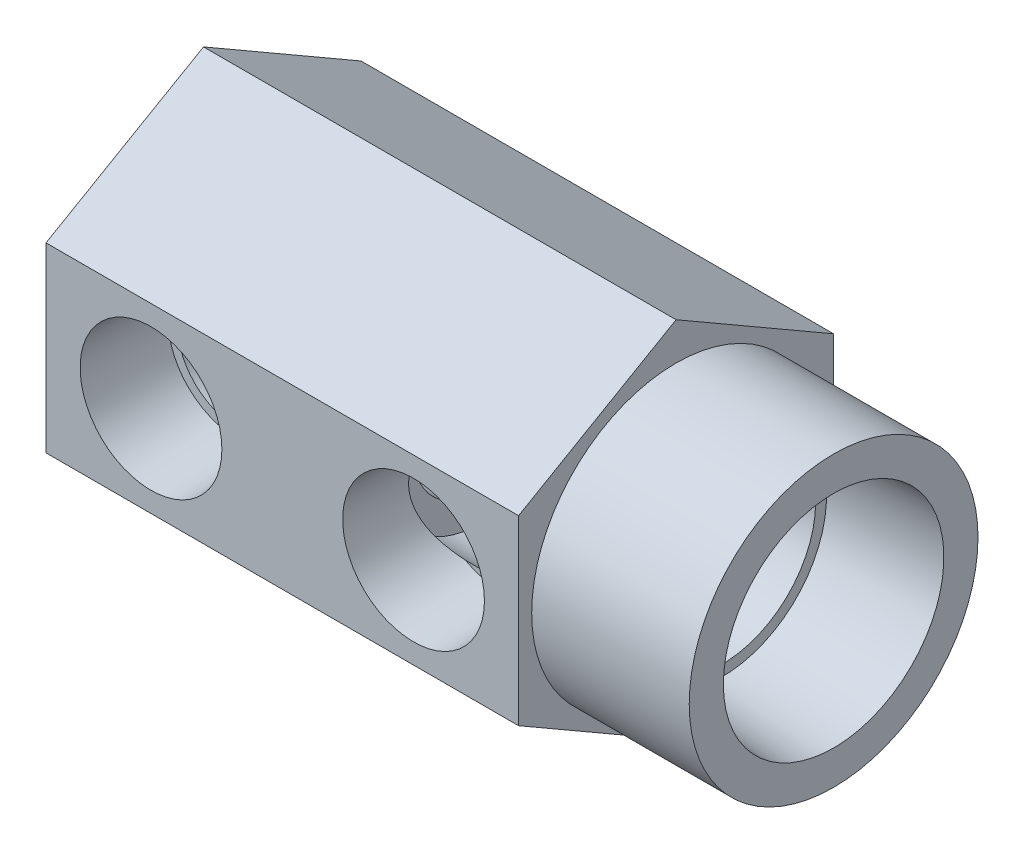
ISO-10303-21;
HEADER;
FILE_DESCRIPTION(('STEP AP214'),'2;1');
FILE_NAME('part.step','',(''),(''),'','','');
FILE_SCHEMA(('AUTOMOTIVE_DESIGN { 1 0 10303 214 1 1 1 1 }'));
ENDSEC;
DATA;
#1=APPLICATION_CONTEXT('core data for automotive mechanical design processes');
#2=APPLICATION_PROTOCOL_DEFINITION('international standard','automotive_design',2000,#1);
#3=PRODUCT_CONTEXT('',#1,'mechanical');
#4=PRODUCT('Part','Part','',(#3));
#5=PRODUCT_RELATED_PRODUCT_CATEGORY('part','',(#4));
#6=PRODUCT_DEFINITION_FORMATION('','',#4);
#7=PRODUCT_DEFINITION_CONTEXT('part definition',#1,'design');
#8=PRODUCT_DEFINITION('design','',#6,#7);
#9=PRODUCT_DEFINITION_SHAPE('','',#8);
#10=(LENGTH_UNIT() NAMED_UNIT(*) SI_UNIT(.MILLI.,.METRE.));
#11=(NAMED_UNIT(*) PLANE_ANGLE_UNIT() SI_UNIT($,.RADIAN.));
#12=(NAMED_UNIT(*) SI_UNIT($,.STERADIAN.) SOLID_ANGLE_UNIT());
#13=UNCERTAINTY_MEASURE_WITH_UNIT(LENGTH_MEASURE(1.E-05),#10,'distance_accuracy_value','');
#14=(GEOMETRIC_REPRESENTATION_CONTEXT(3) GLOBAL_UNCERTAINTY_ASSIGNED_CONTEXT((#13)) GLOBAL_UNIT_ASSIGNED_CONTEXT((#10,
#11,#12)) REPRESENTATION_CONTEXT('',''));
#15=CARTESIAN_POINT('',(0.,0.,0.));
#16=DIRECTION('',(0.,0.,1.));
#17=DIRECTION('',(1.,0.,0.));
#18=AXIS2_PLACEMENT_3D('',#15,#16,#17);
#19=CARTESIAN_POINT('',(76.2,0.,0.));
#20=DIRECTION('',(-1.,0.,0.));
#21=DIRECTION('',(0.,0.,1.));
#22=AXIS2_PLACEMENT_3D('',#19,#20,#21);
#23=PLANE('',#22);
#24=CARTESIAN_POINT('',(76.2,0.,0.));
#25=DIRECTION('',(-1.,0.,0.));
#26=DIRECTION('',(0.,0.,1.));
#27=AXIS2_PLACEMENT_3D('',#24,#25,#26);
#28=CIRCLE('',#27,17.4625);
#29=CARTESIAN_POINT('',(76.2,0.,17.4625));
#30=VERTEX_POINT('',#29);
#31=EDGE_CURVE('E209',#30,#30,#28,.T.);
#32=ORIENTED_EDGE('',*,*,#31,.F.);
#33=EDGE_LOOP('',(#32));
#34=FACE_BOUND('',#33,.T.);
#35=CARTESIAN_POINT('',(76.2,0.,0.));
#36=DIRECTION('',(-1.,0.,0.));
#37=DIRECTION('',(0.,0.,1.));
#38=AXIS2_PLACEMENT_3D('',#35,#36,#37);
#39=CIRCLE('',#38,13.335);
#40=CARTESIAN_POINT('',(76.2,0.,13.335));
#41=VERTEX_POINT('',#40);
#42=EDGE_CURVE('E203',#41,#41,#39,.T.);
#43=ORIENTED_EDGE('',*,*,#42,.T.);
#44=EDGE_LOOP('',(#43));
#45=FACE_BOUND('',#44,.T.);
#46=ADVANCED_FACE('F34',(#34,#45),#23,.F.);
#47=CARTESIAN_POINT('',(57.15,10.9985226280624,19.05));
#48=DIRECTION('',(0.,0.,-1.));
#49=DIRECTION('',(-1.,0.,0.));
#50=AXIS2_PLACEMENT_3D('',#47,#48,#49);
#51=PLANE('',#50);
#52=CARTESIAN_POINT('',(12.7,0.,19.05));
#53=DIRECTION('',(0.,0.,1.));
#54=DIRECTION('',(1.,0.,0.));
#55=AXIS2_PLACEMENT_3D('',#52,#53,#54);
#56=CIRCLE('',#55,8.5725);
#57=CARTESIAN_POINT('',(21.2725,0.,19.05));
#58=VERTEX_POINT('',#57);
#59=EDGE_CURVE('E182',#58,#58,#56,.T.);
#60=ORIENTED_EDGE('',*,*,#59,.F.);
#61=EDGE_LOOP('',(#60));
#62=FACE_BOUND('',#61,.T.);
#63=CARTESIAN_POINT('',(44.45,0.,19.05));
#64=DIRECTION('',(0.,0.,1.));
#65=DIRECTION('',(1.,0.,0.));
#66=AXIS2_PLACEMENT_3D('',#63,#64,#65);
#67=CIRCLE('',#66,8.5725);
#68=CARTESIAN_POINT('',(53.0225,0.,19.05));
#69=VERTEX_POINT('',#68);
#70=EDGE_CURVE('E191',#69,#69,#67,.T.);
#71=ORIENTED_EDGE('',*,*,#70,.F.);
#72=EDGE_LOOP('',(#71));
#73=FACE_BOUND('',#72,.T.);
#74=DIRECTION('',(0.,-1.,0.));
#75=VECTOR('',#74,1.);
#76=CARTESIAN_POINT('',(0.,10.9985226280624,19.05));
#77=LINE('',#76,#75);
#78=CARTESIAN_POINT('',(0.,10.9985226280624,19.05));
#79=VERTEX_POINT('',#78);
#80=CARTESIAN_POINT('',(0.,-10.9985226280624,19.05));
#81=VERTEX_POINT('',#80);
#82=EDGE_CURVE('E212',#79,#81,#77,.T.);
#83=ORIENTED_EDGE('',*,*,#82,.T.);
#84=DIRECTION('',(-1.,0.,0.));
#85=VECTOR('',#84,1.);
#86=CARTESIAN_POINT('',(57.15,-10.9985226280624,19.05));
#87=LINE('',#86,#85);
#88=CARTESIAN_POINT('',(57.15,-10.9985226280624,19.05));
#89=VERTEX_POINT('',#88);
#90=EDGE_CURVE('E217',#89,#81,#87,.T.);
#91=ORIENTED_EDGE('',*,*,#90,.F.);
#92=DIRECTION('',(0.,-1.,0.));
#93=VECTOR('',#92,1.);
#94=CARTESIAN_POINT('',(57.15,10.9985226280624,19.05));
#95=LINE('',#94,#93);
#96=CARTESIAN_POINT('',(57.15,10.9985226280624,19.05));
#97=VERTEX_POINT('',#96);
#98=EDGE_CURVE('E218',#97,#89,#95,.T.);
#99=ORIENTED_EDGE('',*,*,#98,.F.);
#100=DIRECTION('',(-1.,0.,0.));
#101=VECTOR('',#100,1.);
#102=CARTESIAN_POINT('',(57.15,10.9985226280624,19.05));
#103=LINE('',#102,#101);
#104=EDGE_CURVE('E232',#97,#79,#103,.T.);
#105=ORIENTED_EDGE('',*,*,#104,.T.);
#106=EDGE_LOOP('',(#83,#91,#99,#105));
#107=FACE_BOUND('',#106,.T.);
#108=ADVANCED_FACE('F36',(#62,#73,#107),#51,.F.);
#109=CARTESIAN_POINT('',(57.15,-10.9985226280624,19.05));
#110=DIRECTION('',(0.,0.866025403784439,-0.5));
#111=DIRECTION('',(0.,0.5,0.866025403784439));
#112=AXIS2_PLACEMENT_3D('',#109,#110,#111);
#113=PLANE('',#112);
#114=DIRECTION('',(0.,-0.5,-0.866025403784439));
#115=VECTOR('',#114,1.);
#116=CARTESIAN_POINT('',(0.,-10.9985226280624,19.05));
#117=LINE('',#116,#115);
#118=CARTESIAN_POINT('',(0.,-21.9970452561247,0.));
#119=VERTEX_POINT('',#118);
#120=EDGE_CURVE('E235',#81,#119,#117,.T.);
#121=ORIENTED_EDGE('',*,*,#120,.T.);
#122=DIRECTION('',(-1.,0.,0.));
#123=VECTOR('',#122,1.);
#124=CARTESIAN_POINT('',(57.15,-21.9970452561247,0.));
#125=LINE('',#124,#123);
#126=CARTESIAN_POINT('',(57.15,-21.9970452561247,0.));
#127=VERTEX_POINT('',#126);
#128=EDGE_CURVE('E255',#127,#119,#125,.T.);
#129=ORIENTED_EDGE('',*,*,#128,.F.);
#130=DIRECTION('',(0.,-0.5,-0.866025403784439));
#131=VECTOR('',#130,1.);
#132=CARTESIAN_POINT('',(57.15,-10.9985226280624,19.05));
#133=LINE('',#132,#131);
#134=EDGE_CURVE('E221',#89,#127,#133,.T.);
#135=ORIENTED_EDGE('',*,*,#134,.F.);
#136=ORIENTED_EDGE('',*,*,#90,.T.);
#137=EDGE_LOOP('',(#121,#129,#135,#136));
#138=FACE_BOUND('',#137,.T.);
#139=ADVANCED_FACE('F316',(#138),#113,.F.);
#140=CARTESIAN_POINT('',(57.15,-21.9970452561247,0.));
#141=DIRECTION('',(0.,0.866025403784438,0.5));
#142=DIRECTION('',(0.,-0.5,0.866025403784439));
#143=AXIS2_PLACEMENT_3D('',#140,#141,#142);
#144=PLANE('',#143);
#145=DIRECTION('',(0.,0.5,-0.866025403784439));
#146=VECTOR('',#145,1.);
#147=CARTESIAN_POINT('',(0.,-21.9970452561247,0.));
#148=LINE('',#147,#146);
#149=CARTESIAN_POINT('',(0.,-10.9985226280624,-19.05));
#150=VERTEX_POINT('',#149);
#151=EDGE_CURVE('E237',#119,#150,#148,.T.);
#152=ORIENTED_EDGE('',*,*,#151,.T.);
#153=DIRECTION('',(-1.,0.,0.));
#154=VECTOR('',#153,1.);
#155=CARTESIAN_POINT('',(57.15,-10.9985226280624,-19.05));
#156=LINE('',#155,#154);
#157=CARTESIAN_POINT('',(57.15,-10.9985226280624,-19.05));
#158=VERTEX_POINT('',#157);
#159=EDGE_CURVE('E252',#158,#150,#156,.T.);
#160=ORIENTED_EDGE('',*,*,#159,.F.);
#161=DIRECTION('',(0.,0.5,-0.866025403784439));
#162=VECTOR('',#161,1.);
#163=CARTESIAN_POINT('',(57.15,-21.9970452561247,0.));
#164=LINE('',#163,#162);
#165=EDGE_CURVE('E224',#127,#158,#164,.T.);
#166=ORIENTED_EDGE('',*,*,#165,.F.);
#167=ORIENTED_EDGE('',*,*,#128,.T.);
#168=EDGE_LOOP('',(#152,#160,#166,#167));
#169=FACE_BOUND('',#168,.T.);
#170=ADVANCED_FACE('F342',(#169),#144,.F.);
#171=CARTESIAN_POINT('',(57.15,-10.9985226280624,-19.05));
#172=DIRECTION('',(0.,0.,1.));
#173=DIRECTION('',(0.,-1.,0.));
#174=AXIS2_PLACEMENT_3D('',#171,#172,#173);
#175=PLANE('',#174);
#176=CARTESIAN_POINT('',(12.7,0.,-19.05));
#177=DIRECTION('',(0.,0.,-1.));
#178=DIRECTION('',(0.,1.,0.));
#179=AXIS2_PLACEMENT_3D('',#176,#177,#178);
#180=CIRCLE('',#179,8.5725);
#181=CARTESIAN_POINT('',(12.7,8.57250000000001,-19.05));
#182=VERTEX_POINT('',#181);
#183=EDGE_CURVE('E123',#182,#182,#180,.T.);
#184=ORIENTED_EDGE('',*,*,#183,.F.);
#185=EDGE_LOOP('',(#184));
#186=FACE_BOUND('',#185,.T.);
#187=DIRECTION('',(0.,1.,0.));
#188=VECTOR('',#187,1.);
#189=CARTESIAN_POINT('',(0.,-10.9985226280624,-19.05));
#190=LINE('',#189,#188);
#191=CARTESIAN_POINT('',(0.,10.9985226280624,-19.05));
#192=VERTEX_POINT('',#191);
#193=EDGE_CURVE('E239',#150,#192,#190,.T.);
#194=ORIENTED_EDGE('',*,*,#193,.T.);
#195=DIRECTION('',(-1.,0.,0.));
#196=VECTOR('',#195,1.);
#197=CARTESIAN_POINT('',(57.15,10.9985226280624,-19.05));
#198=LINE('',#197,#196);
#199=CARTESIAN_POINT('',(57.15,10.9985226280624,-19.05));
#200=VERTEX_POINT('',#199);
#201=EDGE_CURVE('E249',#200,#192,#198,.T.);
#202=ORIENTED_EDGE('',*,*,#201,.F.);
#203=DIRECTION('',(0.,1.,0.));
#204=VECTOR('',#203,1.);
#205=CARTESIAN_POINT('',(57.15,-10.9985226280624,-19.05));
#206=LINE('',#205,#204);
#207=EDGE_CURVE('E226',#158,#200,#206,.T.);
#208=ORIENTED_EDGE('',*,*,#207,.F.);
#209=ORIENTED_EDGE('',*,*,#159,.T.);
#210=EDGE_LOOP('',(#194,#202,#208,#209));
#211=FACE_BOUND('',#210,.T.);
#212=ADVANCED_FACE('F338',(#186,#211),#175,.F.);
#213=CARTESIAN_POINT('',(57.15,10.9985226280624,-19.05));
#214=DIRECTION('',(0.,-0.866025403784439,0.5));
#215=DIRECTION('',(0.,-0.5,-0.866025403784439));
#216=AXIS2_PLACEMENT_3D('',#213,#214,#215);
#217=PLANE('',#216);
#218=DIRECTION('',(0.,0.5,0.866025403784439));
#219=VECTOR('',#218,1.);
#220=CARTESIAN_POINT('',(0.,10.9985226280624,-19.05));
#221=LINE('',#220,#219);
#222=CARTESIAN_POINT('',(0.,21.9970452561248,0.));
#223=VERTEX_POINT('',#222);
#224=EDGE_CURVE('E241',#192,#223,#221,.T.);
#225=ORIENTED_EDGE('',*,*,#224,.T.);
#226=DIRECTION('',(-1.,0.,0.));
#227=VECTOR('',#226,1.);
#228=CARTESIAN_POINT('',(57.15,21.9970452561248,0.));
#229=LINE('',#228,#227);
#230=CARTESIAN_POINT('',(57.15,21.9970452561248,0.));
#231=VERTEX_POINT('',#230);
#232=EDGE_CURVE('E246',#231,#223,#229,.T.);
#233=ORIENTED_EDGE('',*,*,#232,.F.);
#234=DIRECTION('',(0.,0.5,0.866025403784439));
#235=VECTOR('',#234,1.);
#236=CARTESIAN_POINT('',(57.15,10.9985226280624,-19.05));
#237=LINE('',#236,#235);
#238=EDGE_CURVE('E228',#200,#231,#237,.T.);
#239=ORIENTED_EDGE('',*,*,#238,.F.);
#240=ORIENTED_EDGE('',*,*,#201,.T.);
#241=EDGE_LOOP('',(#225,#233,#239,#240));
#242=FACE_BOUND('',#241,.T.);
#243=ADVANCED_FACE('F334',(#242),#217,.F.);
#244=CARTESIAN_POINT('',(57.15,21.9970452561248,0.));
#245=DIRECTION('',(0.,-0.866025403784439,-0.5));
#246=DIRECTION('',(0.,0.5,-0.866025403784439));
#247=AXIS2_PLACEMENT_3D('',#244,#245,#246);
#248=PLANE('',#247);
#249=DIRECTION('',(0.,-0.5,0.866025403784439));
#250=VECTOR('',#249,1.);
#251=CARTESIAN_POINT('',(0.,21.9970452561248,0.));
#252=LINE('',#251,#250);
#253=EDGE_CURVE('E222',#223,#79,#252,.T.);
#254=ORIENTED_EDGE('',*,*,#253,.T.);
#255=ORIENTED_EDGE('',*,*,#104,.F.);
#256=DIRECTION('',(0.,-0.5,0.866025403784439));
#257=VECTOR('',#256,1.);
#258=CARTESIAN_POINT('',(57.15,21.9970452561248,0.));
#259=LINE('',#258,#257);
#260=EDGE_CURVE('E230',#231,#97,#259,.T.);
#261=ORIENTED_EDGE('',*,*,#260,.F.);
#262=ORIENTED_EDGE('',*,*,#232,.T.);
#263=EDGE_LOOP('',(#254,#255,#261,#262));
#264=FACE_BOUND('',#263,.T.);
#265=ADVANCED_FACE('F327',(#264),#248,.F.);
#266=CARTESIAN_POINT('',(57.15,-10.9985226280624,19.05));
#267=DIRECTION('',(1.,0.,0.));
#268=DIRECTION('',(0.,0.,-1.));
#269=AXIS2_PLACEMENT_3D('',#266,#267,#268);
#270=PLANE('',#269);
#271=CARTESIAN_POINT('',(57.15,0.,0.));
#272=DIRECTION('',(1.,0.,0.));
#273=DIRECTION('',(0.,0.,-1.));
#274=AXIS2_PLACEMENT_3D('',#271,#272,#273);
#275=CIRCLE('',#274,17.4625);
#276=CARTESIAN_POINT('',(57.15,0.,17.4625));
#277=VERTEX_POINT('',#276);
#278=EDGE_CURVE('E213',#277,#277,#275,.T.);
#279=ORIENTED_EDGE('',*,*,#278,.F.);
#280=EDGE_LOOP('',(#279));
#281=FACE_BOUND('',#280,.T.);
#282=ORIENTED_EDGE('',*,*,#98,.T.);
#283=ORIENTED_EDGE('',*,*,#134,.T.);
#284=ORIENTED_EDGE('',*,*,#165,.T.);
#285=ORIENTED_EDGE('',*,*,#207,.T.);
#286=ORIENTED_EDGE('',*,*,#238,.T.);
#287=ORIENTED_EDGE('',*,*,#260,.T.);
#288=EDGE_LOOP('',(#282,#283,#284,#285,#286,#287));
#289=FACE_BOUND('',#288,.T.);
#290=ADVANCED_FACE('F324',(#281,#289),#270,.T.);
#291=CARTESIAN_POINT('',(0.,-10.9985226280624,19.05));
#292=DIRECTION('',(1.,0.,0.));
#293=DIRECTION('',(0.,0.,-1.));
#294=AXIS2_PLACEMENT_3D('',#291,#292,#293);
#295=PLANE('',#294);
#296=ORIENTED_EDGE('',*,*,#82,.F.);
#297=ORIENTED_EDGE('',*,*,#253,.F.);
#298=ORIENTED_EDGE('',*,*,#224,.F.);
#299=ORIENTED_EDGE('',*,*,#193,.F.);
#300=ORIENTED_EDGE('',*,*,#151,.F.);
#301=ORIENTED_EDGE('',*,*,#120,.F.);
#302=EDGE_LOOP('',(#296,#297,#298,#299,#300,#301));
#303=FACE_BOUND('',#302,.T.);
#304=ADVANCED_FACE('F322',(#303),#295,.F.);
#305=CARTESIAN_POINT('',(76.2,0.,0.));
#306=DIRECTION('',(-1.,0.,0.));
#307=DIRECTION('',(0.,0.,1.));
#308=AXIS2_PLACEMENT_3D('',#305,#306,#307);
#309=CYLINDRICAL_SURFACE('',#308,17.4625);
#310=CARTESIAN_POINT('',(57.15,0.,17.4625));
#311=CARTESIAN_POINT('',(57.3484375,0.,17.4625));
#312=CARTESIAN_POINT('',(57.546875,0.,17.4625));
#313=CARTESIAN_POINT('',(57.94375,0.,17.4625));
#314=CARTESIAN_POINT('',(58.1421875,0.,17.4625));
#315=CARTESIAN_POINT('',(58.5390625,0.,17.4625));
#316=CARTESIAN_POINT('',(58.7375,0.,17.4625));
#317=CARTESIAN_POINT('',(59.134375,0.,17.4625));
#318=CARTESIAN_POINT('',(59.3328125,0.,17.4625));
#319=CARTESIAN_POINT('',(59.7296875,0.,17.4625));
#320=CARTESIAN_POINT('',(59.928125,0.,17.4625));
#321=CARTESIAN_POINT('',(60.325,0.,17.4625));
#322=CARTESIAN_POINT('',(60.5234375,0.,17.4625));
#323=CARTESIAN_POINT('',(60.9203125,0.,17.4625));
#324=CARTESIAN_POINT('',(61.11875,0.,17.4625));
#325=CARTESIAN_POINT('',(61.515625,0.,17.4625));
#326=CARTESIAN_POINT('',(61.7140625,0.,17.4625));
#327=CARTESIAN_POINT('',(62.1109375,0.,17.4625));
#328=CARTESIAN_POINT('',(62.309375,0.,17.4625));
#329=CARTESIAN_POINT('',(62.70625,0.,17.4625));
#330=CARTESIAN_POINT('',(62.9046875,0.,17.4625));
#331=CARTESIAN_POINT('',(63.3015625,0.,17.4625));
#332=CARTESIAN_POINT('',(63.5,0.,17.4625));
#333=CARTESIAN_POINT('',(63.896875,0.,17.4625));
#334=CARTESIAN_POINT('',(64.0953125,0.,17.4625));
#335=CARTESIAN_POINT('',(64.4921875,0.,17.4625));
#336=CARTESIAN_POINT('',(64.690625,0.,17.4625));
#337=CARTESIAN_POINT('',(65.0875,0.,17.4625));
#338=CARTESIAN_POINT('',(65.2859375,0.,17.4625));
#339=CARTESIAN_POINT('',(65.6828125,0.,17.4625));
#340=CARTESIAN_POINT('',(65.88125,0.,17.4625));
#341=CARTESIAN_POINT('',(66.278125,0.,17.4625));
#342=CARTESIAN_POINT('',(66.4765625,0.,17.4625));
#343=CARTESIAN_POINT('',(66.8734375,0.,17.4625));
#344=CARTESIAN_POINT('',(67.071875,0.,17.4625));
#345=CARTESIAN_POINT('',(67.46875,0.,17.4625));
#346=CARTESIAN_POINT('',(67.6671875,0.,17.4625));
#347=CARTESIAN_POINT('',(68.0640625,0.,17.4625));
#348=CARTESIAN_POINT('',(68.2625,0.,17.4625));
#349=CARTESIAN_POINT('',(68.659375,0.,17.4625));
#350=CARTESIAN_POINT('',(68.8578125,0.,17.4625));
#351=CARTESIAN_POINT('',(69.2546875,0.,17.4625));
#352=CARTESIAN_POINT('',(69.453125,0.,17.4625));
#353=CARTESIAN_POINT('',(69.85,0.,17.4625));
#354=CARTESIAN_POINT('',(70.0484375,0.,17.4625));
#355=CARTESIAN_POINT('',(70.4453125,0.,17.4625));
#356=CARTESIAN_POINT('',(70.64375,0.,17.4625));
#357=CARTESIAN_POINT('',(71.040625,0.,17.4625));
#358=CARTESIAN_POINT('',(71.2390625,0.,17.4625));
#359=CARTESIAN_POINT('',(71.6359375,0.,17.4625));
#360=CARTESIAN_POINT('',(71.834375,0.,17.4625));
#361=CARTESIAN_POINT('',(72.23125,0.,17.4625));
#362=CARTESIAN_POINT('',(72.4296875,0.,17.4625));
#363=CARTESIAN_POINT('',(72.8265625,0.,17.4625));
#364=CARTESIAN_POINT('',(73.025,0.,17.4625));
#365=CARTESIAN_POINT('',(73.421875,0.,17.4625));
#366=CARTESIAN_POINT('',(73.6203125,0.,17.4625));
#367=CARTESIAN_POINT('',(74.0171875,0.,17.4625));
#368=CARTESIAN_POINT('',(74.215625,0.,17.4625));
#369=CARTESIAN_POINT('',(74.6125,0.,17.4625));
#370=CARTESIAN_POINT('',(74.8109375,0.,17.4625));
#371=CARTESIAN_POINT('',(75.2078125,0.,17.4625));
#372=CARTESIAN_POINT('',(75.40625,0.,17.4625));
#373=CARTESIAN_POINT('',(75.803125,0.,17.4625));
#374=CARTESIAN_POINT('',(76.0015625,0.,17.4625));
#375=CARTESIAN_POINT('',(76.2,0.,17.4625));
#376=B_SPLINE_CURVE_WITH_KNOTS('',3,(#310,#311,#312,#313,#314,#315,#316,#317,#318,#319,#320,
#321,#322,#323,#324,#325,#326,#327,#328,#329,#330,#331,#332,#333,#334,#335,#336,#337,#338,#339,
#340,#341,#342,#343,#344,#345,#346,#347,#348,#349,#350,#351,#352,#353,#354,#355,#356,#357,#358,
#359,#360,#361,#362,#363,#364,#365,#366,#367,#368,#369,#370,#371,#372,#373,#374,#375),
.UNSPECIFIED.,.F.,.F.,(4,2,2,2,2,2,2,2,2,2,2,2,2,2,2,2,2,2,2,2,2,2,2,2,2,2,2,2,2,2,2,2,4),(0.,
0.5953125,1.190625,1.7859375,2.38125,2.9765625,3.571875,4.1671875,4.7625,5.3578125,5.953125,
6.5484375,7.14375,7.7390625,8.334375,8.92968750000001,9.52500000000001,10.1203125,10.715625,
11.3109375,11.90625,12.5015625,13.096875,13.6921875,14.2875,14.8828125,15.478125,16.0734375,
16.66875,17.2640625,17.859375,18.4546875,19.05),.UNSPECIFIED.);
#377=EDGE_CURVE('BSEAM301',#277,#30,#376,.T.);
#378=ORIENTED_EDGE('',*,*,#278,.T.);
#379=ORIENTED_EDGE('',*,*,#31,.T.);
#380=ORIENTED_EDGE('',*,*,#377,.T.);
#381=ORIENTED_EDGE('',*,*,#377,.F.);
#382=EDGE_LOOP('',(#378,#380,#379,#381));
#383=FACE_BOUND('',#382,.T.);
#384=ADVANCED_FACE('F301',(#383),#309,.T.);
#385=CARTESIAN_POINT('',(62.7126,11.3157,0.));
#386=DIRECTION('',(1.,0.,0.));
#387=DIRECTION('',(0.,0.,-1.));
#388=AXIS2_PLACEMENT_3D('',#385,#386,#387);
#389=PLANE('',#388);
#390=CARTESIAN_POINT('',(62.7126,0.,0.));
#391=DIRECTION('',(-1.,0.,0.));
#392=DIRECTION('',(0.,0.,1.));
#393=AXIS2_PLACEMENT_3D('',#390,#391,#392);
#394=CIRCLE('',#393,11.3157);
#395=CARTESIAN_POINT('',(62.7126,0.,11.3157));
#396=VERTEX_POINT('',#395);
#397=EDGE_CURVE('E197',#396,#396,#394,.T.);
#398=ORIENTED_EDGE('',*,*,#397,.T.);
#399=EDGE_LOOP('',(#398));
#400=FACE_BOUND('',#399,.T.);
#401=CARTESIAN_POINT('',(62.7126,0.,0.));
#402=DIRECTION('',(-1.,0.,0.));
#403=DIRECTION('',(0.,0.,1.));
#404=AXIS2_PLACEMENT_3D('',#401,#402,#403);
#405=CIRCLE('',#404,12.6281553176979);
#406=CARTESIAN_POINT('',(62.7126,0.,12.6281553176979));
#407=VERTEX_POINT('',#406);
#408=EDGE_CURVE('E206',#407,#407,#405,.T.);
#409=ORIENTED_EDGE('',*,*,#408,.F.);
#410=EDGE_LOOP('',(#409));
#411=FACE_BOUND('',#410,.T.);
#412=ADVANCED_FACE('F297',(#400,#411),#389,.T.);
#413=CARTESIAN_POINT('',(76.2,0.,0.));
#414=DIRECTION('',(1.,0.,0.));
#415=DIRECTION('',(0.,0.,-1.));
#416=AXIS2_PLACEMENT_3D('',#413,#414,#415);
#417=CONICAL_SURFACE('',#416,13.335,0.0523598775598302);
#418=ORIENTED_EDGE('',*,*,#408,.T.);
#419=EDGE_LOOP('',(#418));
#420=FACE_BOUND('',#419,.T.);
#421=ORIENTED_EDGE('',*,*,#42,.F.);
#422=EDGE_LOOP('',(#421));
#423=FACE_BOUND('',#422,.T.);
#424=ADVANCED_FACE('F300',(#420,#423),#417,.F.);
#425=CARTESIAN_POINT('',(33.3375,0.,0.));
#426=DIRECTION('',(1.,0.,0.));
#427=DIRECTION('',(0.,0.,-1.));
#428=AXIS2_PLACEMENT_3D('',#425,#426,#427);
#429=PLANE('',#428);
#430=CARTESIAN_POINT('',(33.3375,0.,0.));
#431=DIRECTION('',(1.,0.,0.));
#432=DIRECTION('',(0.,0.,-1.));
#433=AXIS2_PLACEMENT_3D('',#430,#431,#432);
#434=CIRCLE('',#433,7.93749999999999);
#435=CARTESIAN_POINT('',(33.3375,0.,-7.93749999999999));
#436=VERTEX_POINT('',#435);
#437=EDGE_CURVE('E38',#436,#436,#434,.T.);
#438=ORIENTED_EDGE('',*,*,#437,.F.);
#439=EDGE_LOOP('',(#438));
#440=FACE_BOUND('',#439,.T.);
#441=CARTESIAN_POINT('',(33.3375,0.,0.));
#442=DIRECTION('',(-1.,0.,0.));
#443=DIRECTION('',(0.,0.,1.));
#444=AXIS2_PLACEMENT_3D('',#441,#442,#443);
#445=CIRCLE('',#444,11.3157);
#446=CARTESIAN_POINT('',(33.3375,0.,11.3157));
#447=VERTEX_POINT('',#446);
#448=EDGE_CURVE('E200',#447,#447,#445,.T.);
#449=ORIENTED_EDGE('',*,*,#448,.F.);
#450=EDGE_LOOP('',(#449));
#451=FACE_BOUND('',#450,.T.);
#452=ADVANCED_FACE('F292',(#440,#451),#429,.T.);
#453=CARTESIAN_POINT('',(0.,0.,0.));
#454=DIRECTION('',(-1.,0.,0.));
#455=DIRECTION('',(0.,0.,1.));
#456=AXIS2_PLACEMENT_3D('',#453,#454,#455);
#457=CYLINDRICAL_SURFACE('',#456,11.3157);
#458=CARTESIAN_POINT('',(48.4832482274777,7.21202423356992,8.71962000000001));
#459=CARTESIAN_POINT('',(48.5925124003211,7.15260118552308,8.76877049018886));
#460=CARTESIAN_POINT('',(48.7001386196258,7.09091491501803,8.81876664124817));
#461=CARTESIAN_POINT('',(48.9120877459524,6.96309485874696,8.92003476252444));
#462=CARTESIAN_POINT('',(49.0164109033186,6.89696141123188,8.97130663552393));
#463=CARTESIAN_POINT('',(49.324389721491,6.6920075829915,9.12641430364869));
#464=CARTESIAN_POINT('',(49.5230754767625,6.54662240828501,9.23155163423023));
#465=CARTESIAN_POINT('',(49.9084902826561,6.23742271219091,9.44325653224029));
#466=CARTESIAN_POINT('',(50.0950828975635,6.0734413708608,9.54982801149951));
#467=CARTESIAN_POINT('',(50.4534552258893,5.72859397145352,9.76058958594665));
#468=CARTESIAN_POINT('',(50.6252350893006,5.54772808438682,9.86477970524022));
#469=CARTESIAN_POINT('',(50.95334425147,5.16902744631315,10.0683940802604));
#470=CARTESIAN_POINT('',(51.1096332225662,4.9711507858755,10.1678055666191));
#471=CARTESIAN_POINT('',(51.4048898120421,4.5593498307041,10.3590018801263));
#472=CARTESIAN_POINT('',(51.5438562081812,4.34542440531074,10.4507861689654));
#473=CARTESIAN_POINT('',(51.8021903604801,3.90338216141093,10.6237828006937));
#474=CARTESIAN_POINT('',(51.9216413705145,3.67533167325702,10.7050397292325));
#475=CARTESIAN_POINT('',(52.1397533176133,3.20558061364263,10.854953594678));
#476=CARTESIAN_POINT('',(52.2384234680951,2.96388615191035,10.9236161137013));
#477=CARTESIAN_POINT('',(52.3882932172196,2.53902338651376,11.0286830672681));
#478=CARTESIAN_POINT('',(52.445021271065,2.35868013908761,11.0687148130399));
#479=CARTESIAN_POINT('',(52.5461470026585,1.99295086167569,11.1403728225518));
#480=CARTESIAN_POINT('',(52.5905474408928,1.80756597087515,11.1720009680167));
#481=CARTESIAN_POINT('',(52.6664301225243,1.43287943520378,11.226208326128));
#482=CARTESIAN_POINT('',(52.6979134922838,1.24357813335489,11.2487883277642));
#483=CARTESIAN_POINT('',(52.7475140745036,0.862328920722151,11.284418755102));
#484=CARTESIAN_POINT('',(52.7656308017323,0.670380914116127,11.2974688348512));
#485=CARTESIAN_POINT('',(52.7882410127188,0.28487061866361,11.313762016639));
#486=CARTESIAN_POINT('',(52.7927065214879,0.0913058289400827,11.3169849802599));
#487=CARTESIAN_POINT('',(52.7878647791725,-0.295559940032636,11.3134932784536));
#488=CARTESIAN_POINT('',(52.7785575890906,-0.488860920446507,11.3067786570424));
#489=CARTESIAN_POINT('',(52.7463150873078,-0.873744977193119,11.2835637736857));
#490=CARTESIAN_POINT('',(52.7233783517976,-1.06532787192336,11.2670624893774));
#491=CARTESIAN_POINT('',(52.6642226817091,-1.44536483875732,11.2246401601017));
#492=CARTESIAN_POINT('',(52.6280037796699,-1.63381891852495,11.1987191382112));
#493=CARTESIAN_POINT('',(52.5440099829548,-2.00105020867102,11.1388729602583));
#494=CARTESIAN_POINT('',(52.4965927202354,-2.17995022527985,11.1051961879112));
#495=CARTESIAN_POINT('',(52.3902683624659,-2.53269300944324,11.0300982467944));
#496=CARTESIAN_POINT('',(52.3313572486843,-2.70653398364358,10.988674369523));
#497=CARTESIAN_POINT('',(52.2027106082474,-3.04823801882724,10.8988304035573));
#498=CARTESIAN_POINT('',(52.1329779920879,-3.21610267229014,10.8504121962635));
#499=CARTESIAN_POINT('',(51.9833334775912,-3.54528615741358,10.74736285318));
#500=CARTESIAN_POINT('',(51.9034179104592,-3.70660260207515,10.6927294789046));
#501=CARTESIAN_POINT('',(51.6304772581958,-4.21511504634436,10.5079429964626));
#502=CARTESIAN_POINT('',(51.4185805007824,-4.54853539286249,10.3670960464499));
#503=CARTESIAN_POINT('',(50.9538811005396,-5.1770594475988,10.0679980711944));
#504=CARTESIAN_POINT('',(50.7010294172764,-5.47211644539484,9.90972625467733));
#505=CARTESIAN_POINT('',(50.2869266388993,-5.89231855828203,9.66199714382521));
#506=CARTESIAN_POINT('',(50.1385941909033,-6.03205879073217,9.57522276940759));
#507=CARTESIAN_POINT('',(49.8322222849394,-6.30008554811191,9.40103824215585));
#508=CARTESIAN_POINT('',(49.6741827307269,-6.42837195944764,9.31362808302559));
#509=CARTESIAN_POINT('',(49.3492433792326,-6.67287312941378,9.14003397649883));
#510=CARTESIAN_POINT('',(49.1823706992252,-6.78912192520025,9.05384720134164));
#511=CARTESIAN_POINT('',(48.8395561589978,-7.00964171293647,8.88422371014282));
#512=CARTESIAN_POINT('',(48.6636139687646,-7.11391226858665,8.80078709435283));
#513=CARTESIAN_POINT('',(48.4832482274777,-7.21202423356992,8.71962));
#514=B_SPLINE_CURVE_WITH_KNOTS('',3,(#458,#459,#460,#461,#462,#463,#464,#465,#466,#467,#468,
#469,#470,#471,#472,#473,#474,#475,#476,#477,#478,#479,#480,#481,#482,#483,#484,#485,#486,#487,
#488,#489,#490,#491,#492,#493,#494,#495,#496,#497,#498,#499,#500,#501,#502,#503,#504,#505,#506,
#507,#508,#509,#510,#511,#512,#513),.UNSPECIFIED.,.F.,.F.,(4,2,2,2,2,2,2,2,2,2,2,2,2,2,2,2,2,2,
2,2,2,2,2,2,2,2,2,4),(0.,0.401138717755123,0.802246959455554,1.60438729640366,2.41439762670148,
3.22439975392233,4.03645804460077,4.84857359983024,5.65712865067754,6.46532446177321,
7.04448228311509,7.62351031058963,8.20248783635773,8.78148637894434,9.36167065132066,
9.94185235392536,10.5220946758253,11.1023355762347,11.66608787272,12.2300376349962,
12.793835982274,13.3578380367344,14.6111296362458,15.8659332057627,16.5299841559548,
17.1940416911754,17.8561671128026,18.5183166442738),.UNSPECIFIED.);
#515=CARTESIAN_POINT('',(48.4836928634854,7.2117824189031,8.71982000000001));
#516=VERTEX_POINT('',#515);
#517=CARTESIAN_POINT('',(48.4836928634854,-7.2117824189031,8.71982000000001));
#518=VERTEX_POINT('',#517);
#519=EDGE_CURVE('E117',#516,#518,#514,.T.);
#520=ORIENTED_EDGE('',*,*,#519,.F.);
#521=DIRECTION('',(-1.,0.,0.));
#522=VECTOR('',#521,1.);
#523=CARTESIAN_POINT('',(0.,7.2117824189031,8.71982000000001));
#524=LINE('',#523,#522);
#525=CARTESIAN_POINT('',(40.4163071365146,7.2117824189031,8.71982000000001));
#526=VERTEX_POINT('',#525);
#527=EDGE_CURVE('E265',#526,#516,#524,.F.);
#528=ORIENTED_EDGE('',*,*,#527,.F.);
#529=CARTESIAN_POINT('',(40.4167517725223,-7.21202423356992,8.71962000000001));
#530=CARTESIAN_POINT('',(40.3074875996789,-7.15260118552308,8.76877049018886));
#531=CARTESIAN_POINT('',(40.1998613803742,-7.09091491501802,8.81876664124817));
#532=CARTESIAN_POINT('',(39.9879122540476,-6.96309485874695,8.92003476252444));
#533=CARTESIAN_POINT('',(39.8835890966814,-6.89696141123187,8.97130663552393));
#534=CARTESIAN_POINT('',(39.575610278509,-6.6920075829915,9.12641430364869));
#535=CARTESIAN_POINT('',(39.3769245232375,-6.54662240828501,9.23155163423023));
#536=CARTESIAN_POINT('',(38.9915097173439,-6.2374227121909,9.44325653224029));
#537=CARTESIAN_POINT('',(38.8049171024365,-6.0734413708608,9.54982801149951));
#538=CARTESIAN_POINT('',(38.4465447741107,-5.72859397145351,9.76058958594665));
#539=CARTESIAN_POINT('',(38.2747649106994,-5.54772808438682,9.86477970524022));
#540=CARTESIAN_POINT('',(37.94665574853,-5.16902744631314,10.0683940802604));
#541=CARTESIAN_POINT('',(37.7903667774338,-4.97115078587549,10.1678055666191));
#542=CARTESIAN_POINT('',(37.4951101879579,-4.55934983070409,10.3590018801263));
#543=CARTESIAN_POINT('',(37.3561437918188,-4.34542440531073,10.4507861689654));
#544=CARTESIAN_POINT('',(37.0978096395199,-3.90338216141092,10.6237828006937));
#545=CARTESIAN_POINT('',(36.9783586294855,-3.67533167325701,10.7050397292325));
#546=CARTESIAN_POINT('',(36.7602466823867,-3.20558061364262,10.854953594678));
#547=CARTESIAN_POINT('',(36.6615765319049,-2.96388615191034,10.9236161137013));
#548=CARTESIAN_POINT('',(36.5117067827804,-2.53902338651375,11.0286830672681));
#549=CARTESIAN_POINT('',(36.4549787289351,-2.3586801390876,11.0687148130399));
#550=CARTESIAN_POINT('',(36.3538529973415,-1.99295086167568,11.1403728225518));
#551=CARTESIAN_POINT('',(36.3094525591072,-1.80756597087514,11.1720009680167));
#552=CARTESIAN_POINT('',(36.2335698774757,-1.43287943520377,11.226208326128));
#553=CARTESIAN_POINT('',(36.2020865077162,-1.24357813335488,11.2487883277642));
#554=CARTESIAN_POINT('',(36.1524859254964,-0.862328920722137,11.284418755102));
#555=CARTESIAN_POINT('',(36.1343691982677,-0.670380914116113,11.2974688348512));
#556=CARTESIAN_POINT('',(36.1117589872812,-0.284870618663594,11.313762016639));
#557=CARTESIAN_POINT('',(36.1072934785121,-0.0913058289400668,11.3169849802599));
#558=CARTESIAN_POINT('',(36.1121352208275,0.295559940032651,11.3134932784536));
#559=CARTESIAN_POINT('',(36.1214424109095,0.488860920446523,11.3067786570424));
#560=CARTESIAN_POINT('',(36.1536849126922,0.873744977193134,11.2835637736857));
#561=CARTESIAN_POINT('',(36.1766216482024,1.06532787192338,11.2670624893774));
#562=CARTESIAN_POINT('',(36.2357773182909,1.44536483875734,11.2246401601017));
#563=CARTESIAN_POINT('',(36.2719962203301,1.63381891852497,11.1987191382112));
#564=CARTESIAN_POINT('',(36.3559900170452,2.00105020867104,11.1388729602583));
#565=CARTESIAN_POINT('',(36.4034072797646,2.17995022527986,11.1051961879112));
#566=CARTESIAN_POINT('',(36.5097316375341,2.53269300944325,11.0300982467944));
#567=CARTESIAN_POINT('',(36.5686427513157,2.70653398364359,10.988674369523));
#568=CARTESIAN_POINT('',(36.6972893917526,3.04823801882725,10.8988304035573));
#569=CARTESIAN_POINT('',(36.7670220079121,3.21610267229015,10.8504121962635));
#570=CARTESIAN_POINT('',(36.9166665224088,3.54528615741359,10.74736285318));
#571=CARTESIAN_POINT('',(36.9965820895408,3.70660260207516,10.6927294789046));
#572=CARTESIAN_POINT('',(37.2695227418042,4.21511504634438,10.5079429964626));
#573=CARTESIAN_POINT('',(37.4814194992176,4.5485353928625,10.3670960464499));
#574=CARTESIAN_POINT('',(37.9461188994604,5.17705944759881,10.0679980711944));
#575=CARTESIAN_POINT('',(38.1989705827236,5.47211644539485,9.90972625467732));
#576=CARTESIAN_POINT('',(38.6130733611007,5.89231855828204,9.6619971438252));
#577=CARTESIAN_POINT('',(38.7614058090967,6.03205879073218,9.57522276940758));
#578=CARTESIAN_POINT('',(39.0677777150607,6.30008554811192,9.40103824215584));
#579=CARTESIAN_POINT('',(39.2258172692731,6.42837195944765,9.31362808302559));
#580=CARTESIAN_POINT('',(39.5507566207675,6.67287312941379,9.14003397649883));
#581=CARTESIAN_POINT('',(39.7176293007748,6.78912192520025,9.05384720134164));
#582=CARTESIAN_POINT('',(40.0604438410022,7.00964171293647,8.88422371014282));
#583=CARTESIAN_POINT('',(40.2363860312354,7.11391226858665,8.80078709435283));
#584=CARTESIAN_POINT('',(40.4167517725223,7.21202423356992,8.71962));
#585=B_SPLINE_CURVE_WITH_KNOTS('',3,(#529,#530,#531,#532,#533,#534,#535,#536,#537,#538,#539,
#540,#541,#542,#543,#544,#545,#546,#547,#548,#549,#550,#551,#552,#553,#554,#555,#556,#557,#558,
#559,#560,#561,#562,#563,#564,#565,#566,#567,#568,#569,#570,#571,#572,#573,#574,#575,#576,#577,
#578,#579,#580,#581,#582,#583,#584),.UNSPECIFIED.,.F.,.F.,(4,2,2,2,2,2,2,2,2,2,2,2,2,2,2,2,2,2,
2,2,2,2,2,2,2,2,2,4),(0.,0.401138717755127,0.802246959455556,1.60438729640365,2.41439762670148,
3.22439975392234,4.03645804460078,4.84857359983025,5.65712865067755,6.46532446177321,
7.04448228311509,7.62351031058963,8.20248783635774,8.78148637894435,9.36167065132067,
9.94185235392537,10.5220946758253,11.1023355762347,11.66608787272,12.2300376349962,
12.793835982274,13.3578380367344,14.6111296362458,15.8659332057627,16.5299841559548,
17.1940416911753,17.8561671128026,18.5183166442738),.UNSPECIFIED.);
#586=CARTESIAN_POINT('',(40.4163071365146,-7.2117824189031,8.71982000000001));
#587=VERTEX_POINT('',#586);
#588=EDGE_CURVE('E216',#587,#526,#585,.T.);
#589=ORIENTED_EDGE('',*,*,#588,.F.);
#590=DIRECTION('',(-1.,0.,0.));
#591=VECTOR('',#590,1.);
#592=CARTESIAN_POINT('',(0.,-7.2117824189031,8.71982000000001));
#593=LINE('',#592,#591);
#594=EDGE_CURVE('E279',#518,#587,#593,.T.);
#595=ORIENTED_EDGE('',*,*,#594,.F.);
#596=EDGE_LOOP('',(#520,#528,#589,#595));
#597=FACE_BOUND('',#596,.T.);
#598=ORIENTED_EDGE('',*,*,#448,.T.);
#599=EDGE_LOOP('',(#598));
#600=FACE_BOUND('',#599,.T.);
#601=ORIENTED_EDGE('',*,*,#397,.F.);
#602=EDGE_LOOP('',(#601));
#603=FACE_BOUND('',#602,.T.);
#604=ADVANCED_FACE('F267',(#597,#600,#603),#457,.F.);
#605=CARTESIAN_POINT('',(51.5874,0.,8.71982000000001));
#606=DIRECTION('',(0.,0.,-1.));
#607=DIRECTION('',(-1.,0.,0.));
#608=AXIS2_PLACEMENT_3D('',#605,#606,#607);
#609=PLANE('',#608);
#610=ORIENTED_EDGE('',*,*,#594,.T.);
#611=CARTESIAN_POINT('',(44.45,0.,8.71982000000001));
#612=DIRECTION('',(0.,0.,1.));
#613=DIRECTION('',(1.,0.,0.));
#614=AXIS2_PLACEMENT_3D('',#611,#612,#613);
#615=CIRCLE('',#614,8.26320057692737);
#616=EDGE_CURVE('E58',#587,#518,#615,.T.);
#617=ORIENTED_EDGE('',*,*,#616,.T.);
#618=EDGE_LOOP('',(#610,#617));
#619=FACE_BOUND('',#618,.T.);
#620=ADVANCED_FACE('F291',(#619),#609,.F.);
#621=ORIENTED_EDGE('',*,*,#527,.T.);
#622=EDGE_CURVE('E194',#516,#526,#615,.T.);
#623=ORIENTED_EDGE('',*,*,#622,.T.);
#624=EDGE_LOOP('',(#621,#623));
#625=FACE_BOUND('',#624,.T.);
#626=ADVANCED_FACE('F274',(#625),#609,.F.);
#627=CARTESIAN_POINT('',(44.45,0.,19.05));
#628=DIRECTION('',(0.,0.,1.));
#629=DIRECTION('',(1.,0.,0.));
#630=AXIS2_PLACEMENT_3D('',#627,#628,#629);
#631=CONICAL_SURFACE('',#630,8.5725,0.0299323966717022);
#632=ORIENTED_EDGE('',*,*,#519,.T.);
#633=ORIENTED_EDGE('',*,*,#616,.F.);
#634=ORIENTED_EDGE('',*,*,#588,.T.);
#635=ORIENTED_EDGE('',*,*,#622,.F.);
#636=EDGE_LOOP('',(#632,#633,#634,#635));
#637=FACE_BOUND('',#636,.T.);
#638=ORIENTED_EDGE('',*,*,#70,.T.);
#639=EDGE_LOOP('',(#638));
#640=FACE_BOUND('',#639,.T.);
#641=ADVANCED_FACE('F271',(#637,#640),#631,.F.);
#642=CARTESIAN_POINT('',(12.7,0.,19.05));
#643=DIRECTION('',(0.,0.,1.));
#644=DIRECTION('',(1.,0.,0.));
#645=AXIS2_PLACEMENT_3D('',#642,#643,#644);
#646=CYLINDRICAL_SURFACE('',#645,7.13740000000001);
#647=CARTESIAN_POINT('',(12.7,7.13740000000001,1.72225752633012));
#648=CARTESIAN_POINT('',(12.7595870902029,7.13740780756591,1.72219425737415));
#649=CARTESIAN_POINT('',(12.8191089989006,7.13665371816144,1.72535095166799));
#650=CARTESIAN_POINT('',(12.9373255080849,7.13369560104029,1.73755665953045));
#651=CARTESIAN_POINT('',(12.996022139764,7.1314961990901,1.74658687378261));
#652=CARTESIAN_POINT('',(13.1679033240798,7.12295687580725,1.78120041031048));
#653=CARTESIAN_POINT('',(13.2794774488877,7.11466879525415,1.81435476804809));
#654=CARTESIAN_POINT('',(13.4789752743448,7.09535627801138,1.88832491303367));
#655=CARTESIAN_POINT('',(13.5678044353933,7.08499166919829,1.92703275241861));
#656=CARTESIAN_POINT('',(13.7417729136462,7.06150716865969,2.01138947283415));
#657=CARTESIAN_POINT('',(13.8269092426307,7.04838509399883,2.05704384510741));
#658=CARTESIAN_POINT('',(13.9951261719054,7.01943851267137,2.15376824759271));
#659=CARTESIAN_POINT('',(14.0781618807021,7.00357904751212,2.20490461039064));
#660=CARTESIAN_POINT('',(14.2415025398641,6.969447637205,2.31052718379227));
#661=CARTESIAN_POINT('',(14.3218083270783,6.95117643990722,2.36501235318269));
#662=CARTESIAN_POINT('',(14.5219562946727,6.9020636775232,2.50564353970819));
#663=CARTESIAN_POINT('',(14.6403255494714,6.86967276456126,2.59333965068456));
#664=CARTESIAN_POINT('',(14.8731228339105,6.7996160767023,2.77183896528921));
#665=CARTESIAN_POINT('',(14.9875493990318,6.76194836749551,2.86264329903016));
#666=CARTESIAN_POINT('',(15.2132879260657,6.68133530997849,3.04605562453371));
#667=CARTESIAN_POINT('',(15.3245960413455,6.63838376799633,3.13866562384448));
#668=CARTESIAN_POINT('',(15.5443880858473,6.54721927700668,3.32465173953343));
#669=CARTESIAN_POINT('',(15.6528716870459,6.49900572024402,3.41802794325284));
#670=CARTESIAN_POINT('',(15.973744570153,6.34673745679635,3.69763002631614));
#671=CARTESIAN_POINT('',(16.1823413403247,6.23477367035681,3.88398153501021));
#672=CARTESIAN_POINT('',(16.5895359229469,5.98919216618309,4.25292562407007));
#673=CARTESIAN_POINT('',(16.7881416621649,5.85559198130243,4.43552111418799));
#674=CARTESIAN_POINT('',(17.1351778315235,5.59540755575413,4.75748883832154));
#675=CARTESIAN_POINT('',(17.2855741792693,5.47295915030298,4.89807499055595));
#676=CARTESIAN_POINT('',(17.5786935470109,5.21336629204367,5.17352108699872));
#677=CARTESIAN_POINT('',(17.7214155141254,5.07621983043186,5.30838024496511));
#678=CARTESIAN_POINT('',(18.1360240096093,4.64240256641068,5.70164913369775));
#679=CARTESIAN_POINT('',(18.3950713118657,4.32282715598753,5.94942196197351));
#680=CARTESIAN_POINT('',(18.8044052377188,3.71172889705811,6.34252648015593));
#681=CARTESIAN_POINT('',(18.9655552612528,3.43398196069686,6.49784259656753));
#682=CARTESIAN_POINT('',(19.181432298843,2.99337467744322,6.70632441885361));
#683=CARTESIAN_POINT('',(19.2490767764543,2.84252721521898,6.77172995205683));
#684=CARTESIAN_POINT('',(19.374782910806,2.53329365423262,6.8933770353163));
#685=CARTESIAN_POINT('',(19.4328459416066,2.37490864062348,6.94961989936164));
#686=CARTESIAN_POINT('',(19.5304635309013,2.07561872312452,7.04423746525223));
#687=CARTESIAN_POINT('',(19.5714872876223,1.93563802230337,7.08402632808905));
#688=CARTESIAN_POINT('',(19.6452503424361,1.65151632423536,7.15559876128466));
#689=CARTESIAN_POINT('',(19.6779911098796,1.50737606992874,7.1873837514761));
#690=CARTESIAN_POINT('',(19.7346508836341,1.21581680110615,7.2424055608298));
#691=CARTESIAN_POINT('',(19.7585732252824,1.06839904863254,7.26564561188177));
#692=CARTESIAN_POINT('',(19.7971926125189,0.771222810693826,7.30317007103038));
#693=CARTESIAN_POINT('',(19.8118895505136,0.62146429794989,7.31745437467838));
#694=CARTESIAN_POINT('',(19.8318110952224,0.320293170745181,7.33681776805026));
#695=CARTESIAN_POINT('',(19.8370086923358,0.16887706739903,7.34187060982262));
#696=CARTESIAN_POINT('',(19.8377487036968,-0.134001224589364,7.34258997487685));
#697=CARTESIAN_POINT('',(19.8332911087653,-0.285463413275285,7.33825648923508));
#698=CARTESIAN_POINT('',(19.8148058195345,-0.587261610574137,7.32028880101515));
#699=CARTESIAN_POINT('',(19.8007769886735,-0.737597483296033,7.30665349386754));
#700=CARTESIAN_POINT('',(19.7634132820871,-1.03599463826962,7.27034791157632));
#701=CARTESIAN_POINT('',(19.7400784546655,-1.18405593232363,7.24767768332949));
#702=CARTESIAN_POINT('',(19.6856648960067,-1.47084082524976,7.19483457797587));
#703=CARTESIAN_POINT('',(19.6549461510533,-1.60969741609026,7.16501057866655));
#704=CARTESIAN_POINT('',(19.5858043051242,-1.88365940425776,7.09791538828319));
#705=CARTESIAN_POINT('',(19.5473782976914,-2.0187633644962,7.06064138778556));
#706=CARTESIAN_POINT('',(19.4213104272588,-2.41743388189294,6.93842594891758));
#707=CARTESIAN_POINT('',(19.3228435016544,-2.67453979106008,6.84305682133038));
#708=CARTESIAN_POINT('',(19.1350038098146,-3.09338853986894,6.66146046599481));
#709=CARTESIAN_POINT('',(19.0517777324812,-3.26058554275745,6.58108631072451));
#710=CARTESIAN_POINT('',(18.8749398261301,-3.58421264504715,6.41057781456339));
#711=CARTESIAN_POINT('',(18.7813246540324,-3.74063925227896,6.32044033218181));
#712=CARTESIAN_POINT('',(18.4865598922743,-4.1938316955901,6.03717195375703));
#713=CARTESIAN_POINT('',(18.2717160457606,-4.47402349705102,5.83140329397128));
#714=CARTESIAN_POINT('',(17.88697452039,-4.90852074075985,5.46521601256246));
#715=CARTESIAN_POINT('',(17.7242079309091,-5.07469443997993,5.31090272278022));
#716=CARTESIAN_POINT('',(17.3877782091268,-5.38700906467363,4.99382234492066));
#717=CARTESIAN_POINT('',(17.2141101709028,-5.5331408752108,4.83105145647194));
#718=CARTESIAN_POINT('',(16.8576347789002,-5.8057635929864,4.49974939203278));
#719=CARTESIAN_POINT('',(16.6748363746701,-5.93227325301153,4.33122390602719));
#720=CARTESIAN_POINT('',(16.3007993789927,-6.16647287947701,3.99073145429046));
#721=CARTESIAN_POINT('',(16.1095640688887,-6.27417008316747,3.81876584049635));
#722=CARTESIAN_POINT('',(15.7148919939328,-6.47323355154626,3.47083699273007));
#723=CARTESIAN_POINT('',(15.5112937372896,-6.56425596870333,3.29485923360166));
#724=CARTESIAN_POINT('',(15.1979611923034,-6.68694525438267,3.03360027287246));
#725=CARTESIAN_POINT('',(15.0920943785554,-6.72556315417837,2.94688744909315));
#726=CARTESIAN_POINT('',(14.8772885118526,-6.79814399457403,2.77534497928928));
#727=CARTESIAN_POINT('',(14.7683499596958,-6.83210768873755,2.69051503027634));
#728=CARTESIAN_POINT('',(14.566095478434,-6.88978953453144,2.53867003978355));
#729=CARTESIAN_POINT('',(14.4733846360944,-6.91426031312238,2.47113678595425));
#730=CARTESIAN_POINT('',(14.2847941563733,-6.95990813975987,2.33948155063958));
#731=CARTESIAN_POINT('',(14.1889153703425,-6.98108606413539,2.27535866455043));
#732=CARTESIAN_POINT('',(13.9933977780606,-7.01993706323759,2.15250204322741));
#733=CARTESIAN_POINT('',(13.8937697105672,-7.03761935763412,2.09375435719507));
#734=CARTESIAN_POINT('',(13.6896112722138,-7.06921453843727,1.98446050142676));
#735=CARTESIAN_POINT('',(13.5850884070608,-7.0831329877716,1.93390227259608));
#736=CARTESIAN_POINT('',(13.3743659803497,-7.10623042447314,1.84717808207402));
#737=CARTESIAN_POINT('',(13.2683918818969,-7.11557348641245,1.81052656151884));
#738=CARTESIAN_POINT('',(13.05184381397,-7.12953385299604,1.7547946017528));
#739=CARTESIAN_POINT('',(12.941296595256,-7.13417545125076,1.73562388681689));
#740=CARTESIAN_POINT('',(12.7867449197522,-7.13700904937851,1.72386624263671));
#741=CARTESIAN_POINT('',(12.7433759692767,-7.1374092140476,1.72219236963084));
#742=CARTESIAN_POINT('',(12.7,-7.13740000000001,1.72225752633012));
#743=B_SPLINE_CURVE_WITH_KNOTS('',3,(#647,#648,#649,#650,#651,#652,#653,#654,#655,#656,#657,
#658,#659,#660,#661,#662,#663,#664,#665,#666,#667,#668,#669,#670,#671,#672,#673,#674,#675,#676,
#677,#678,#679,#680,#681,#682,#683,#684,#685,#686,#687,#688,#689,#690,#691,#692,#693,#694,#695,
#696,#697,#698,#699,#700,#701,#702,#703,#704,#705,#706,#707,#708,#709,#710,#711,#712,#713,#714,
#715,#716,#717,#718,#719,#720,#721,#722,#723,#724,#725,#726,#727,#728,#729,#730,#731,#732,#733,
#734,#735,#736,#737,#738,#739,#740,#741,#742),.UNSPECIFIED.,.F.,.F.,(4,2,2,2,2,2,2,2,2,2,2,2,2,
2,2,2,2,2,2,2,2,2,2,2,2,2,2,2,2,2,2,2,2,2,2,2,2,2,2,2,2,2,2,2,2,2,2,4),(0.,0.178562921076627,
0.356557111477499,0.70488594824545,0.996848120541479,1.28904230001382,1.58528923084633,
1.88144451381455,2.33370880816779,2.78613932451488,3.23910532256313,3.69212369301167,
4.59499217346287,5.49713265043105,6.21510009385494,6.93316578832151,8.36598334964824,
9.43185513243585,9.96466378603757,10.4973959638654,10.9505286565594,11.4035809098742,
11.8564616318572,12.3093476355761,12.7635193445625,13.2176914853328,13.6719175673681,
14.1261412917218,14.5615886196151,14.9972004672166,15.8678681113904,16.4771106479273,
17.086549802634,18.3071429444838,19.1436376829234,19.9805116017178,20.8165807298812,
21.6523275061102,22.5037355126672,22.9302175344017,23.3566304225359,23.7083679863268,
24.0600117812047,24.410715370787,24.7608977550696,25.0973841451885,25.432122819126,
25.5622212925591),.UNSPECIFIED.);
#744=CARTESIAN_POINT('',(12.7,7.13740000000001,1.7222575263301));
#745=VERTEX_POINT('',#744);
#746=CARTESIAN_POINT('',(12.7,-7.13740000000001,1.7222575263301));
#747=VERTEX_POINT('',#746);
#748=EDGE_CURVE('E43',#745,#747,#743,.T.);
#749=ORIENTED_EDGE('',*,*,#748,.T.);
#750=CARTESIAN_POINT('',(13.5329643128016,-7.08862816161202,5.0930048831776));
#751=CARTESIAN_POINT('',(13.4626435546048,-7.09690189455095,4.88085205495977));
#752=CARTESIAN_POINT('',(13.3945755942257,-7.10382787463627,4.66788738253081));
#753=CARTESIAN_POINT('',(13.2636523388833,-7.11541181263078,4.23900856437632));
#754=CARTESIAN_POINT('',(13.2008281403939,-7.12005694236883,4.02308460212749));
#755=CARTESIAN_POINT('',(13.0439381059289,-7.1297752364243,3.45083209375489));
#756=CARTESIAN_POINT('',(12.955538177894,-7.13322780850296,3.09288740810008));
#757=CARTESIAN_POINT('',(12.8027630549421,-7.13707475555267,2.37170623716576));
#758=CARTESIAN_POINT('',(12.7383883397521,-7.13746906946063,2.00846964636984));
#759=CARTESIAN_POINT('',(12.664565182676,-7.13735315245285,1.46143312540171));
#760=CARTESIAN_POINT('',(12.6437688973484,-7.13719776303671,1.2791399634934));
#761=CARTESIAN_POINT('',(12.6102366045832,-7.13685564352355,0.913822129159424));
#762=CARTESIAN_POINT('',(12.5974996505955,-7.13666891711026,0.73079754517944));
#763=CARTESIAN_POINT('',(12.5804988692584,-7.13640469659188,0.364391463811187));
#764=CARTESIAN_POINT('',(12.5762331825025,-7.13632717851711,0.181010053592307));
#765=CARTESIAN_POINT('',(12.5763045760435,-7.1363277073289,-0.185737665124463));
#766=CARTESIAN_POINT('',(12.5806412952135,-7.13640574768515,-0.369103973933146));
#767=CARTESIAN_POINT('',(12.602077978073,-7.13674181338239,-0.826956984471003));
#768=CARTESIAN_POINT('',(12.624471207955,-7.13707027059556,-1.10120796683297));
#769=CARTESIAN_POINT('',(12.6867754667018,-7.13745381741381,-1.64765977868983));
#770=CARTESIAN_POINT('',(12.7266869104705,-7.13750890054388,-1.91986055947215));
#771=CARTESIAN_POINT('',(12.8218429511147,-7.13651834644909,-2.46280179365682));
#772=CARTESIAN_POINT('',(12.877156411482,-7.13546770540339,-2.73352998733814));
#773=CARTESIAN_POINT('',(13.0004079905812,-7.1313415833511,-3.27204765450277));
#774=CARTESIAN_POINT('',(13.0683465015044,-7.12826603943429,-3.5398370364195));
#775=CARTESIAN_POINT('',(13.2385083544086,-7.11771925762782,-4.16055427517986));
#776=CARTESIAN_POINT('',(13.3446436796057,-7.10913158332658,-4.51238516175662));
#777=CARTESIAN_POINT('',(13.5701534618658,-7.08506810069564,-5.21158370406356));
#778=CARTESIAN_POINT('',(13.6895314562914,-7.06959044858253,-5.55895013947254));
#779=CARTESIAN_POINT('',(13.9380855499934,-7.03032577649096,-6.2500966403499));
#780=CARTESIAN_POINT('',(14.0672721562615,-7.00652974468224,-6.59387239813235));
#781=CARTESIAN_POINT('',(14.3326853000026,-6.94947865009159,-7.2778531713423));
#782=CARTESIAN_POINT('',(14.4689110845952,-6.91622459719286,-7.61805856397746));
#783=CARTESIAN_POINT('',(14.7462272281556,-6.83930646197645,-8.29460218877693));
#784=CARTESIAN_POINT('',(14.8873087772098,-6.79566046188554,-8.63094608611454));
#785=CARTESIAN_POINT('',(15.173088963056,-6.6969526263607,-9.3004423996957));
#786=CARTESIAN_POINT('',(15.3177878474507,-6.64189000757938,-9.63359459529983));
#787=CARTESIAN_POINT('',(15.6094666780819,-6.51939307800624,-10.2962157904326));
#788=CARTESIAN_POINT('',(15.7564442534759,-6.45197092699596,-10.6256880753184));
#789=CARTESIAN_POINT('',(16.0518010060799,-6.30358894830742,-11.2808994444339));
#790=CARTESIAN_POINT('',(16.2001799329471,-6.22263149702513,-11.606639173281));
#791=CARTESIAN_POINT('',(16.4073132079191,-6.09942085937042,-12.0576145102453));
#792=CARTESIAN_POINT('',(16.4658662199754,-6.06345901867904,-12.1846811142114));
#793=CARTESIAN_POINT('',(16.5829925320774,-5.98912887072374,-12.4380969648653));
#794=CARTESIAN_POINT('',(16.6415658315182,-5.95076062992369,-12.5644462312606));
#795=CARTESIAN_POINT('',(16.8171999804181,-5.83190337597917,-12.9422644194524));
#796=CARTESIAN_POINT('',(16.9342076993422,-5.74764258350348,-13.1925746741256));
#797=CARTESIAN_POINT('',(17.0509153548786,-5.65791607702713,-13.4411031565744));
#798=B_SPLINE_CURVE_WITH_KNOTS('',3,(#750,#751,#752,#753,#754,#755,#756,#757,#758,#759,#760,
#761,#762,#763,#764,#765,#766,#767,#768,#769,#770,#771,#772,#773,#774,#775,#776,#777,#778,#779,
#780,#781,#782,#783,#784,#785,#786,#787,#788,#789,#790,#791,#792,#793,#794,#795,#796,#797),
.UNSPECIFIED.,.F.,.F.,(4,2,2,2,2,2,2,2,2,2,2,2,2,2,2,2,2,2,2,2,2,2,2,4),(0.,0.670964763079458,
1.34566119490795,2.4511703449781,3.55670156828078,4.10697638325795,4.65718655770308,
5.207275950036,5.75734225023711,6.58216915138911,7.40701558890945,8.23561088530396,
9.06423192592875,10.1665726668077,11.2692085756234,12.3730427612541,13.4767591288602,
14.5785688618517,15.6804542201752,16.7812612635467,17.8818752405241,18.3152275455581,
18.7485678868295,19.6150074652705),.UNSPECIFIED.);
#799=CARTESIAN_POINT('',(12.7,-7.13740000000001,-1.7222575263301));
#800=VERTEX_POINT('',#799);
#801=EDGE_CURVE('E11',#747,#800,#798,.T.);
#802=ORIENTED_EDGE('',*,*,#801,.T.);
#803=CARTESIAN_POINT('',(12.7,-7.13740000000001,-1.72225752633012));
#804=CARTESIAN_POINT('',(12.7595870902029,-7.13740780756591,-1.72219425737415));
#805=CARTESIAN_POINT('',(12.8191089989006,-7.13665371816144,-1.72535095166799));
#806=CARTESIAN_POINT('',(12.9373255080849,-7.13369560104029,-1.73755665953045));
#807=CARTESIAN_POINT('',(12.996022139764,-7.1314961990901,-1.74658687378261));
#808=CARTESIAN_POINT('',(13.1679033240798,-7.12295687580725,-1.78120041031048));
#809=CARTESIAN_POINT('',(13.2794774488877,-7.11466879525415,-1.81435476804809));
#810=CARTESIAN_POINT('',(13.4789752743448,-7.09535627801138,-1.88832491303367));
#811=CARTESIAN_POINT('',(13.5678044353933,-7.08499166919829,-1.92703275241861));
#812=CARTESIAN_POINT('',(13.7417729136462,-7.06150716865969,-2.01138947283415));
#813=CARTESIAN_POINT('',(13.8269092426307,-7.04838509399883,-2.05704384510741));
#814=CARTESIAN_POINT('',(13.9951261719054,-7.01943851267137,-2.15376824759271));
#815=CARTESIAN_POINT('',(14.0781618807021,-7.00357904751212,-2.20490461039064));
#816=CARTESIAN_POINT('',(14.2415025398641,-6.969447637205,-2.31052718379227));
#817=CARTESIAN_POINT('',(14.3218083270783,-6.95117643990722,-2.36501235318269));
#818=CARTESIAN_POINT('',(14.5219562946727,-6.9020636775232,-2.50564353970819));
#819=CARTESIAN_POINT('',(14.6403255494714,-6.86967276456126,-2.59333965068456));
#820=CARTESIAN_POINT('',(14.8731228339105,-6.7996160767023,-2.77183896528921));
#821=CARTESIAN_POINT('',(14.9875493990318,-6.76194836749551,-2.86264329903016));
#822=CARTESIAN_POINT('',(15.2132879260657,-6.68133530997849,-3.04605562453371));
#823=CARTESIAN_POINT('',(15.3245960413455,-6.63838376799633,-3.13866562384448));
#824=CARTESIAN_POINT('',(15.5443880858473,-6.54721927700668,-3.32465173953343));
#825=CARTESIAN_POINT('',(15.6528716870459,-6.49900572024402,-3.41802794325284));
#826=CARTESIAN_POINT('',(15.973744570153,-6.34673745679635,-3.69763002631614));
#827=CARTESIAN_POINT('',(16.1823413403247,-6.23477367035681,-3.88398153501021));
#828=CARTESIAN_POINT('',(16.5895359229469,-5.98919216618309,-4.25292562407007));
#829=CARTESIAN_POINT('',(16.7881416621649,-5.85559198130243,-4.43552111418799));
#830=CARTESIAN_POINT('',(17.1351778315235,-5.59540755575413,-4.75748883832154));
#831=CARTESIAN_POINT('',(17.2855741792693,-5.47295915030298,-4.89807499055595));
#832=CARTESIAN_POINT('',(17.5786935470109,-5.21336629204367,-5.17352108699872));
#833=CARTESIAN_POINT('',(17.7214155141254,-5.07621983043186,-5.30838024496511));
#834=CARTESIAN_POINT('',(18.1360240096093,-4.64240256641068,-5.70164913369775));
#835=CARTESIAN_POINT('',(18.3950713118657,-4.32282715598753,-5.94942196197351));
#836=CARTESIAN_POINT('',(18.8044052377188,-3.71172889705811,-6.34252648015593));
#837=CARTESIAN_POINT('',(18.9655552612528,-3.43398196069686,-6.49784259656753));
#838=CARTESIAN_POINT('',(19.181432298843,-2.99337467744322,-6.70632441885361));
#839=CARTESIAN_POINT('',(19.2490767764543,-2.84252721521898,-6.77172995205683));
#840=CARTESIAN_POINT('',(19.374782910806,-2.53329365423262,-6.8933770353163));
#841=CARTESIAN_POINT('',(19.4328459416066,-2.37490864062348,-6.94961989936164));
#842=CARTESIAN_POINT('',(19.5304635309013,-2.07561872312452,-7.04423746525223));
#843=CARTESIAN_POINT('',(19.5714872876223,-1.93563802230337,-7.08402632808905));
#844=CARTESIAN_POINT('',(19.6452503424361,-1.65151632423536,-7.15559876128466));
#845=CARTESIAN_POINT('',(19.6779911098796,-1.50737606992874,-7.1873837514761));
#846=CARTESIAN_POINT('',(19.7346508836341,-1.21581680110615,-7.2424055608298));
#847=CARTESIAN_POINT('',(19.7585732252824,-1.06839904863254,-7.26564561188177));
#848=CARTESIAN_POINT('',(19.7971926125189,-0.771222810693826,-7.30317007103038));
#849=CARTESIAN_POINT('',(19.8118895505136,-0.62146429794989,-7.31745437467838));
#850=CARTESIAN_POINT('',(19.8318110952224,-0.320293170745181,-7.33681776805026));
#851=CARTESIAN_POINT('',(19.8370086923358,-0.16887706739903,-7.34187060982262));
#852=CARTESIAN_POINT('',(19.8377487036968,0.134001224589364,-7.34258997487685));
#853=CARTESIAN_POINT('',(19.8332911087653,0.285463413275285,-7.33825648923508));
#854=CARTESIAN_POINT('',(19.8148058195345,0.587261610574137,-7.32028880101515));
#855=CARTESIAN_POINT('',(19.8007769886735,0.737597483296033,-7.30665349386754));
#856=CARTESIAN_POINT('',(19.7634132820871,1.03599463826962,-7.27034791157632));
#857=CARTESIAN_POINT('',(19.7400784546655,1.18405593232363,-7.24767768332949));
#858=CARTESIAN_POINT('',(19.6856648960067,1.47084082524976,-7.19483457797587));
#859=CARTESIAN_POINT('',(19.6549461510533,1.60969741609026,-7.16501057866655));
#860=CARTESIAN_POINT('',(19.5858043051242,1.88365940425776,-7.09791538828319));
#861=CARTESIAN_POINT('',(19.5473782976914,2.0187633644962,-7.06064138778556));
#862=CARTESIAN_POINT('',(19.4213104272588,2.41743388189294,-6.93842594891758));
#863=CARTESIAN_POINT('',(19.3228435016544,2.67453979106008,-6.84305682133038));
#864=CARTESIAN_POINT('',(19.1350038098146,3.09338853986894,-6.66146046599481));
#865=CARTESIAN_POINT('',(19.0517777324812,3.26058554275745,-6.58108631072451));
#866=CARTESIAN_POINT('',(18.8749398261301,3.58421264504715,-6.41057781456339));
#867=CARTESIAN_POINT('',(18.7813246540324,3.74063925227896,-6.32044033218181));
#868=CARTESIAN_POINT('',(18.4865598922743,4.1938316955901,-6.03717195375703));
#869=CARTESIAN_POINT('',(18.2717160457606,4.47402349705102,-5.83140329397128));
#870=CARTESIAN_POINT('',(17.88697452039,4.90852074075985,-5.46521601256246));
#871=CARTESIAN_POINT('',(17.7242079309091,5.07469443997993,-5.31090272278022));
#872=CARTESIAN_POINT('',(17.3877782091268,5.38700906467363,-4.99382234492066));
#873=CARTESIAN_POINT('',(17.2141101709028,5.5331408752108,-4.83105145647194));
#874=CARTESIAN_POINT('',(16.8576347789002,5.8057635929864,-4.49974939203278));
#875=CARTESIAN_POINT('',(16.6748363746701,5.93227325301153,-4.33122390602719));
#876=CARTESIAN_POINT('',(16.3007993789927,6.16647287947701,-3.99073145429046));
#877=CARTESIAN_POINT('',(16.1095640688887,6.27417008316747,-3.81876584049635));
#878=CARTESIAN_POINT('',(15.7148919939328,6.47323355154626,-3.47083699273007));
#879=CARTESIAN_POINT('',(15.5112937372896,6.56425596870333,-3.29485923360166));
#880=CARTESIAN_POINT('',(15.1979611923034,6.68694525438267,-3.03360027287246));
#881=CARTESIAN_POINT('',(15.0920943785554,6.72556315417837,-2.94688744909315));
#882=CARTESIAN_POINT('',(14.8772885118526,6.79814399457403,-2.77534497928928));
#883=CARTESIAN_POINT('',(14.7683499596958,6.83210768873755,-2.69051503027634));
#884=CARTESIAN_POINT('',(14.566095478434,6.88978953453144,-2.53867003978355));
#885=CARTESIAN_POINT('',(14.4733846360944,6.91426031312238,-2.47113678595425));
#886=CARTESIAN_POINT('',(14.2847941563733,6.95990813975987,-2.33948155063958));
#887=CARTESIAN_POINT('',(14.1889153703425,6.98108606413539,-2.27535866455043));
#888=CARTESIAN_POINT('',(13.9933977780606,7.01993706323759,-2.15250204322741));
#889=CARTESIAN_POINT('',(13.8937697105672,7.03761935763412,-2.09375435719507));
#890=CARTESIAN_POINT('',(13.6896112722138,7.06921453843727,-1.98446050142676));
#891=CARTESIAN_POINT('',(13.5850884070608,7.0831329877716,-1.93390227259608));
#892=CARTESIAN_POINT('',(13.3743659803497,7.10623042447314,-1.84717808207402));
#893=CARTESIAN_POINT('',(13.2683918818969,7.11557348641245,-1.81052656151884));
#894=CARTESIAN_POINT('',(13.05184381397,7.12953385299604,-1.7547946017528));
#895=CARTESIAN_POINT('',(12.941296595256,7.13417545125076,-1.73562388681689));
#896=CARTESIAN_POINT('',(12.7867449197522,7.13700904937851,-1.72386624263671));
#897=CARTESIAN_POINT('',(12.7433759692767,7.1374092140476,-1.72219236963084));
#898=CARTESIAN_POINT('',(12.7,7.13740000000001,-1.72225752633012));
#899=B_SPLINE_CURVE_WITH_KNOTS('',3,(#803,#804,#805,#806,#807,#808,#809,#810,#811,#812,#813,
#814,#815,#816,#817,#818,#819,#820,#821,#822,#823,#824,#825,#826,#827,#828,#829,#830,#831,#832,
#833,#834,#835,#836,#837,#838,#839,#840,#841,#842,#843,#844,#845,#846,#847,#848,#849,#850,#851,
#852,#853,#854,#855,#856,#857,#858,#859,#860,#861,#862,#863,#864,#865,#866,#867,#868,#869,#870,
#871,#872,#873,#874,#875,#876,#877,#878,#879,#880,#881,#882,#883,#884,#885,#886,#887,#888,#889,
#890,#891,#892,#893,#894,#895,#896,#897,#898),.UNSPECIFIED.,.F.,.F.,(4,2,2,2,2,2,2,2,2,2,2,2,2,
2,2,2,2,2,2,2,2,2,2,2,2,2,2,2,2,2,2,2,2,2,2,2,2,2,2,2,2,2,2,2,2,2,2,4),(0.,0.178562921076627,
0.356557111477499,0.70488594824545,0.996848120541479,1.28904230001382,1.58528923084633,
1.88144451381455,2.33370880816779,2.78613932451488,3.23910532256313,3.69212369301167,
4.59499217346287,5.49713265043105,6.21510009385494,6.93316578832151,8.36598334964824,
9.43185513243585,9.96466378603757,10.4973959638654,10.9505286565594,11.4035809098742,
11.8564616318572,12.3093476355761,12.7635193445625,13.2176914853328,13.6719175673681,
14.1261412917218,14.5615886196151,14.9972004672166,15.8678681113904,16.4771106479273,
17.086549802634,18.3071429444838,19.1436376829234,19.9805116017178,20.8165807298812,
21.6523275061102,22.5037355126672,22.9302175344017,23.3566304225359,23.7083679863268,
24.0600117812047,24.410715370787,24.7608977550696,25.0973841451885,25.432122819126,
25.5622212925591),.UNSPECIFIED.);
#900=CARTESIAN_POINT('',(12.7,7.13740000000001,-1.7222575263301));
#901=VERTEX_POINT('',#900);
#902=EDGE_CURVE('E116',#800,#901,#899,.T.);
#903=ORIENTED_EDGE('',*,*,#902,.T.);
#904=CARTESIAN_POINT('',(13.5329643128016,7.08862816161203,-5.0930048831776));
#905=CARTESIAN_POINT('',(13.4626435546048,7.09690189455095,-4.88085205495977));
#906=CARTESIAN_POINT('',(13.3945755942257,7.10382787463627,-4.66788738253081));
#907=CARTESIAN_POINT('',(13.2636523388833,7.11541181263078,-4.23900856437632));
#908=CARTESIAN_POINT('',(13.2008281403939,7.12005694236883,-4.02308460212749));
#909=CARTESIAN_POINT('',(13.0439381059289,7.1297752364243,-3.4508320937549));
#910=CARTESIAN_POINT('',(12.955538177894,7.13322780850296,-3.09288740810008));
#911=CARTESIAN_POINT('',(12.8027630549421,7.13707475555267,-2.37170623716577));
#912=CARTESIAN_POINT('',(12.7383883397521,7.13746906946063,-2.00846964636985));
#913=CARTESIAN_POINT('',(12.664565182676,7.13735315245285,-1.46143312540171));
#914=CARTESIAN_POINT('',(12.6437688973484,7.13719776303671,-1.27913996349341));
#915=CARTESIAN_POINT('',(12.6102366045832,7.13685564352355,-0.913822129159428));
#916=CARTESIAN_POINT('',(12.5974996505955,7.13666891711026,-0.730797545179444));
#917=CARTESIAN_POINT('',(12.5804988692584,7.13640469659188,-0.364391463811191));
#918=CARTESIAN_POINT('',(12.5762331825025,7.13632717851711,-0.181010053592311));
#919=CARTESIAN_POINT('',(12.5763045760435,7.1363277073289,0.185737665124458));
#920=CARTESIAN_POINT('',(12.5806412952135,7.13640574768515,0.369103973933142));
#921=CARTESIAN_POINT('',(12.602077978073,7.13674181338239,0.826956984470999));
#922=CARTESIAN_POINT('',(12.624471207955,7.13707027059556,1.10120796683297));
#923=CARTESIAN_POINT('',(12.6867754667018,7.13745381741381,1.64765977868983));
#924=CARTESIAN_POINT('',(12.7266869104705,7.13750890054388,1.91986055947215));
#925=CARTESIAN_POINT('',(12.8218429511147,7.13651834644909,2.46280179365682));
#926=CARTESIAN_POINT('',(12.877156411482,7.13546770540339,2.73352998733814));
#927=CARTESIAN_POINT('',(13.0004079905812,7.1313415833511,3.27204765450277));
#928=CARTESIAN_POINT('',(13.0683465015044,7.12826603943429,3.5398370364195));
#929=CARTESIAN_POINT('',(13.2385083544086,7.11771925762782,4.16055427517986));
#930=CARTESIAN_POINT('',(13.3446436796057,7.10913158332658,4.51238516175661));
#931=CARTESIAN_POINT('',(13.5701534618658,7.08506810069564,5.21158370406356));
#932=CARTESIAN_POINT('',(13.6895314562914,7.06959044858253,5.55895013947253));
#933=CARTESIAN_POINT('',(13.9380855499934,7.03032577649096,6.2500966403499));
#934=CARTESIAN_POINT('',(14.0672721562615,7.00652974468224,6.59387239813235));
#935=CARTESIAN_POINT('',(14.3326853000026,6.94947865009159,7.2778531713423));
#936=CARTESIAN_POINT('',(14.4689110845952,6.91622459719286,7.61805856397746));
#937=CARTESIAN_POINT('',(14.7462272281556,6.83930646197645,8.29460218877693));
#938=CARTESIAN_POINT('',(14.8873087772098,6.79566046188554,8.63094608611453));
#939=CARTESIAN_POINT('',(15.173088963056,6.6969526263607,9.3004423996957));
#940=CARTESIAN_POINT('',(15.3177878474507,6.64189000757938,9.63359459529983));
#941=CARTESIAN_POINT('',(15.6094666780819,6.51939307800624,10.2962157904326));
#942=CARTESIAN_POINT('',(15.7564442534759,6.45197092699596,10.6256880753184));
#943=CARTESIAN_POINT('',(16.0518010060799,6.30358894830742,11.2808994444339));
#944=CARTESIAN_POINT('',(16.2001799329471,6.22263149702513,11.606639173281));
#945=CARTESIAN_POINT('',(16.4073132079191,6.09942085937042,12.0576145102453));
#946=CARTESIAN_POINT('',(16.4658662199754,6.06345901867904,12.1846811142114));
#947=CARTESIAN_POINT('',(16.5829925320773,5.98912887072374,12.4380969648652));
#948=CARTESIAN_POINT('',(16.6415658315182,5.95076062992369,12.5644462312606));
#949=CARTESIAN_POINT('',(16.8171999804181,5.83190337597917,12.9422644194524));
#950=CARTESIAN_POINT('',(16.9342076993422,5.74764258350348,13.1925746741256));
#951=CARTESIAN_POINT('',(17.0509153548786,5.65791607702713,13.4411031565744));
#952=B_SPLINE_CURVE_WITH_KNOTS('',3,(#904,#905,#906,#907,#908,#909,#910,#911,#912,#913,#914,
#915,#916,#917,#918,#919,#920,#921,#922,#923,#924,#925,#926,#927,#928,#929,#930,#931,#932,#933,
#934,#935,#936,#937,#938,#939,#940,#941,#942,#943,#944,#945,#946,#947,#948,#949,#950,#951),
.UNSPECIFIED.,.F.,.F.,(4,2,2,2,2,2,2,2,2,2,2,2,2,2,2,2,2,2,2,2,2,2,2,4),(0.,0.670964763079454,
1.34566119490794,2.45117034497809,3.55670156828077,4.10697638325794,4.65718655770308,
5.20727595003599,5.7573422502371,6.5821691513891,7.40701558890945,8.23561088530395,
9.06423192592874,10.1665726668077,11.2692085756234,12.3730427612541,13.4767591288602,
14.5785688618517,15.6804542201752,16.7812612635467,17.881875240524,18.3152275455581,
18.7485678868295,19.6150074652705),.UNSPECIFIED.);
#953=EDGE_CURVE('E111',#901,#745,#952,.T.);
#954=ORIENTED_EDGE('',*,*,#953,.T.);
#955=EDGE_LOOP('',(#749,#802,#903,#954));
#956=FACE_BOUND('',#955,.T.);
#957=CARTESIAN_POINT('',(12.7,0.,8.71982000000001));
#958=DIRECTION('',(0.,0.,1.));
#959=DIRECTION('',(1.,0.,0.));
#960=AXIS2_PLACEMENT_3D('',#957,#958,#959);
#961=CIRCLE('',#960,7.13740000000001);
#962=CARTESIAN_POINT('',(19.8374,0.,8.71982000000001));
#963=VERTEX_POINT('',#962);
#964=EDGE_CURVE('E188',#963,#963,#961,.T.);
#965=ORIENTED_EDGE('',*,*,#964,.T.);
#966=EDGE_LOOP('',(#965));
#967=FACE_BOUND('',#966,.T.);
#968=CARTESIAN_POINT('',(12.7,0.,-8.71982000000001));
#969=DIRECTION('',(0.,0.,-1.));
#970=DIRECTION('',(0.,1.,0.));
#971=AXIS2_PLACEMENT_3D('',#968,#969,#970);
#972=CIRCLE('',#971,7.13740000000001);
#973=CARTESIAN_POINT('',(12.7,7.13740000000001,-8.71982));
#974=VERTEX_POINT('',#973);
#975=EDGE_CURVE('E179',#974,#974,#972,.T.);
#976=ORIENTED_EDGE('',*,*,#975,.T.);
#977=EDGE_LOOP('',(#976));
#978=FACE_BOUND('',#977,.T.);
#979=ADVANCED_FACE('F126',(#956,#967,#978),#646,.F.);
#980=CARTESIAN_POINT('',(19.8374,0.,8.71982000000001));
#981=DIRECTION('',(0.,0.,-1.));
#982=DIRECTION('',(-1.,0.,0.));
#983=AXIS2_PLACEMENT_3D('',#980,#981,#982);
#984=PLANE('',#983);
#985=ORIENTED_EDGE('',*,*,#964,.F.);
#986=EDGE_LOOP('',(#985));
#987=FACE_BOUND('',#986,.T.);
#988=CARTESIAN_POINT('',(12.7,0.,8.71982000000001));
#989=DIRECTION('',(0.,0.,1.));
#990=DIRECTION('',(1.,0.,0.));
#991=AXIS2_PLACEMENT_3D('',#988,#989,#990);
#992=CIRCLE('',#991,8.26320057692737);
#993=CARTESIAN_POINT('',(20.9632005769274,0.,8.71982000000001));
#994=VERTEX_POINT('',#993);
#995=EDGE_CURVE('E185',#994,#994,#992,.T.);
#996=ORIENTED_EDGE('',*,*,#995,.T.);
#997=EDGE_LOOP('',(#996));
#998=FACE_BOUND('',#997,.T.);
#999=ADVANCED_FACE('F442',(#987,#998),#984,.F.);
#1000=CARTESIAN_POINT('',(12.7,0.,19.05));
#1001=DIRECTION('',(0.,0.,1.));
#1002=DIRECTION('',(1.,0.,0.));
#1003=AXIS2_PLACEMENT_3D('',#1000,#1001,#1002);
#1004=CONICAL_SURFACE('',#1003,8.5725,0.0299323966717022);
#1005=ORIENTED_EDGE('',*,*,#995,.F.);
#1006=EDGE_LOOP('',(#1005));
#1007=FACE_BOUND('',#1006,.T.);
#1008=ORIENTED_EDGE('',*,*,#59,.T.);
#1009=EDGE_LOOP('',(#1008));
#1010=FACE_BOUND('',#1009,.T.);
#1011=ADVANCED_FACE('F449',(#1007,#1010),#1004,.F.);
#1012=CARTESIAN_POINT('',(19.8374,0.,-8.71982000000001));
#1013=DIRECTION('',(0.,0.,1.));
#1014=DIRECTION('',(0.,-1.,0.));
#1015=AXIS2_PLACEMENT_3D('',#1012,#1013,#1014);
#1016=PLANE('',#1015);
#1017=ORIENTED_EDGE('',*,*,#975,.F.);
#1018=EDGE_LOOP('',(#1017));
#1019=FACE_BOUND('',#1018,.T.);
#1020=CARTESIAN_POINT('',(12.7,0.,-8.71982000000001));
#1021=DIRECTION('',(0.,0.,-1.));
#1022=DIRECTION('',(0.,1.,0.));
#1023=AXIS2_PLACEMENT_3D('',#1020,#1021,#1022);
#1024=CIRCLE('',#1023,8.26320057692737);
#1025=CARTESIAN_POINT('',(12.7,8.26320057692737,-8.71982000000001));
#1026=VERTEX_POINT('',#1025);
#1027=EDGE_CURVE('E176',#1026,#1026,#1024,.T.);
#1028=ORIENTED_EDGE('',*,*,#1027,.T.);
#1029=EDGE_LOOP('',(#1028));
#1030=FACE_BOUND('',#1029,.T.);
#1031=ADVANCED_FACE('F455',(#1019,#1030),#1016,.F.);
#1032=CARTESIAN_POINT('',(12.7,0.,-19.05));
#1033=DIRECTION('',(0.,0.,-1.));
#1034=DIRECTION('',(0.,1.,0.));
#1035=AXIS2_PLACEMENT_3D('',#1032,#1033,#1034);
#1036=CONICAL_SURFACE('',#1035,8.5725,0.0299323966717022);
#1037=ORIENTED_EDGE('',*,*,#1027,.F.);
#1038=EDGE_LOOP('',(#1037));
#1039=FACE_BOUND('',#1038,.T.);
#1040=ORIENTED_EDGE('',*,*,#183,.T.);
#1041=EDGE_LOOP('',(#1040));
#1042=FACE_BOUND('',#1041,.T.);
#1043=ADVANCED_FACE('F150',(#1039,#1042),#1036,.F.);
#1044=CARTESIAN_POINT('',(76.2,0.,0.));
#1045=DIRECTION('',(1.,0.,0.));
#1046=DIRECTION('',(0.,0.,-1.));
#1047=AXIS2_PLACEMENT_3D('',#1044,#1045,#1046);
#1048=CYLINDRICAL_SURFACE('',#1047,7.34225099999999);
#1049=CARTESIAN_POINT('',(26.6298383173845,0.,0.));
#1050=DIRECTION('',(1.,0.,0.));
#1051=DIRECTION('',(0.,0.,-1.));
#1052=AXIS2_PLACEMENT_3D('',#1049,#1050,#1051);
#1053=CIRCLE('',#1052,7.34225099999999);
#1054=CARTESIAN_POINT('',(26.6298383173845,0.,-7.34225099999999));
#1055=VERTEX_POINT('',#1054);
#1056=EDGE_CURVE('E164',#1055,#1055,#1053,.T.);
#1057=ORIENTED_EDGE('',*,*,#1056,.T.);
#1058=EDGE_LOOP('',(#1057));
#1059=FACE_BOUND('',#1058,.T.);
#1060=CARTESIAN_POINT('',(12.7,0.,0.));
#1061=DIRECTION('',(1.,0.,0.));
#1062=DIRECTION('',(0.,0.,-1.));
#1063=AXIS2_PLACEMENT_3D('',#1060,#1061,#1062);
#1064=CIRCLE('',#1063,7.34225099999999);
#1065=EDGE_CURVE('E50',#901,#745,#1064,.T.);
#1066=ORIENTED_EDGE('',*,*,#1065,.F.);
#1067=ORIENTED_EDGE('',*,*,#902,.F.);
#1068=EDGE_CURVE('E124',#747,#800,#1064,.T.);
#1069=ORIENTED_EDGE('',*,*,#1068,.F.);
#1070=ORIENTED_EDGE('',*,*,#748,.F.);
#1071=EDGE_LOOP('',(#1066,#1067,#1069,#1070));
#1072=FACE_BOUND('',#1071,.T.);
#1073=ADVANCED_FACE('F120',(#1059,#1072),#1048,.F.);
#1074=CARTESIAN_POINT('',(12.7,0.,0.));
#1075=DIRECTION('',(1.,0.,0.));
#1076=DIRECTION('',(0.,0.,-1.));
#1077=AXIS2_PLACEMENT_3D('',#1074,#1075,#1076);
#1078=CONICAL_SURFACE('',#1077,7.34225099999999,1.02974425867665);
#1079=ORIENTED_EDGE('',*,*,#1068,.T.);
#1080=ORIENTED_EDGE('',*,*,#801,.F.);
#1081=EDGE_LOOP('',(#1079,#1080));
#1082=FACE_BOUND('',#1081,.T.);
#1083=ADVANCED_FACE('F149',(#1082),#1078,.F.);
#1084=ORIENTED_EDGE('',*,*,#1065,.T.);
#1085=ORIENTED_EDGE('',*,*,#953,.F.);
#1086=EDGE_LOOP('',(#1084,#1085));
#1087=FACE_BOUND('',#1086,.T.);
#1088=ADVANCED_FACE('F112',(#1087),#1078,.F.);
#1089=CARTESIAN_POINT('',(26.9875,0.,0.));
#1090=DIRECTION('',(1.,0.,0.));
#1091=DIRECTION('',(0.,0.,-1.));
#1092=AXIS2_PLACEMENT_3D('',#1089,#1090,#1091);
#1093=CONICAL_SURFACE('',#1092,7.93749999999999,1.02974425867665);
#1094=CARTESIAN_POINT('',(26.9875,0.,0.));
#1095=DIRECTION('',(1.,0.,0.));
#1096=DIRECTION('',(0.,0.,-1.));
#1097=AXIS2_PLACEMENT_3D('',#1094,#1095,#1096);
#1098=CIRCLE('',#1097,7.93749999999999);
#1099=CARTESIAN_POINT('',(26.9875,0.,-7.93749999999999));
#1100=VERTEX_POINT('',#1099);
#1101=EDGE_CURVE('E166',#1100,#1100,#1098,.T.);
#1102=ORIENTED_EDGE('',*,*,#1101,.T.);
#1103=EDGE_LOOP('',(#1102));
#1104=FACE_BOUND('',#1103,.T.);
#1105=ORIENTED_EDGE('',*,*,#1056,.F.);
#1106=EDGE_LOOP('',(#1105));
#1107=FACE_BOUND('',#1106,.T.);
#1108=ADVANCED_FACE('F152',(#1104,#1107),#1093,.F.);
#1109=CARTESIAN_POINT('',(76.2,0.,0.));
#1110=DIRECTION('',(1.,0.,0.));
#1111=DIRECTION('',(0.,0.,-1.));
#1112=AXIS2_PLACEMENT_3D('',#1109,#1110,#1111);
#1113=CYLINDRICAL_SURFACE('',#1112,7.93749999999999);
#1114=ORIENTED_EDGE('',*,*,#437,.T.);
#1115=EDGE_LOOP('',(#1114));
#1116=FACE_BOUND('',#1115,.T.);
#1117=ORIENTED_EDGE('',*,*,#1101,.F.);
#1118=EDGE_LOOP('',(#1117));
#1119=FACE_BOUND('',#1118,.T.);
#1120=ADVANCED_FACE('F483',(#1116,#1119),#1113,.F.);
#1121=CLOSED_SHELL('',(#46,#108,#139,#170,#212,#243,#265,#290,#304,#384,#412,#424,#452,#604,
#620,#626,#641,#979,#999,#1011,#1031,#1043,#1073,#1083,#1088,#1108,#1120));
#1122=MANIFOLD_SOLID_BREP('B2',#1121);
#1123=ADVANCED_BREP_SHAPE_REPRESENTATION('',(#18,#1122),#14);
#1124=SHAPE_DEFINITION_REPRESENTATION(#9,#1123);
ENDSEC;
END-ISO-10303-21;
